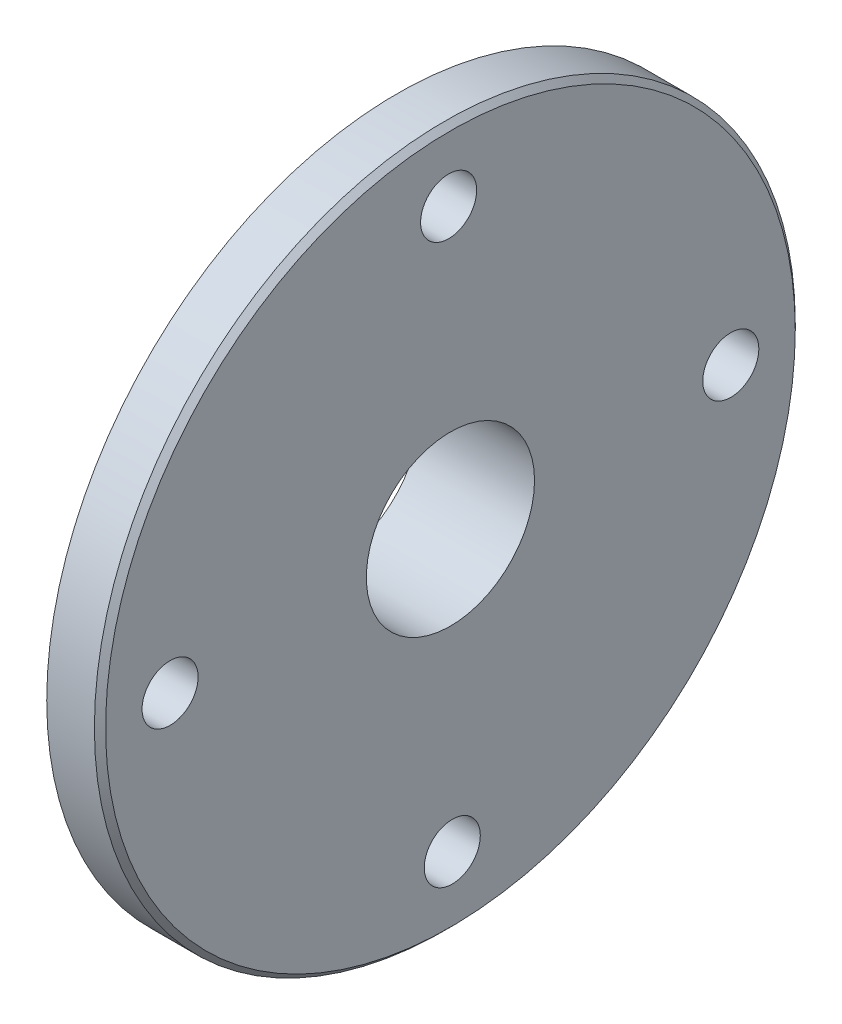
ISO-10303-21;
HEADER;
FILE_DESCRIPTION(('STEP AP214'),'2;1');
FILE_NAME('part.step','',(''),(''),'','','');
FILE_SCHEMA(('AUTOMOTIVE_DESIGN { 1 0 10303 214 1 1 1 1 }'));
ENDSEC;
DATA;
#1=APPLICATION_CONTEXT('core data for automotive mechanical design processes');
#2=APPLICATION_PROTOCOL_DEFINITION('international standard','automotive_design',2000,#1);
#3=PRODUCT_CONTEXT('',#1,'mechanical');
#4=PRODUCT('Part','Part','',(#3));
#5=PRODUCT_RELATED_PRODUCT_CATEGORY('part','',(#4));
#6=PRODUCT_DEFINITION_FORMATION('','',#4);
#7=PRODUCT_DEFINITION_CONTEXT('part definition',#1,'design');
#8=PRODUCT_DEFINITION('design','',#6,#7);
#9=PRODUCT_DEFINITION_SHAPE('','',#8);
#10=(LENGTH_UNIT() NAMED_UNIT(*) SI_UNIT(.MILLI.,.METRE.));
#11=(NAMED_UNIT(*) PLANE_ANGLE_UNIT() SI_UNIT($,.RADIAN.));
#12=(NAMED_UNIT(*) SI_UNIT($,.STERADIAN.) SOLID_ANGLE_UNIT());
#13=UNCERTAINTY_MEASURE_WITH_UNIT(LENGTH_MEASURE(1.E-05),#10,'distance_accuracy_value','');
#14=(GEOMETRIC_REPRESENTATION_CONTEXT(3) GLOBAL_UNCERTAINTY_ASSIGNED_CONTEXT((#13)) GLOBAL_UNIT_ASSIGNED_CONTEXT((#10,
#11,#12)) REPRESENTATION_CONTEXT('',''));
#15=CARTESIAN_POINT('',(0.,0.,0.));
#16=DIRECTION('',(0.,0.,1.));
#17=DIRECTION('',(1.,0.,0.));
#18=AXIS2_PLACEMENT_3D('',#15,#16,#17);
#19=CARTESIAN_POINT('',(-9.5,62.5,0.));
#20=DIRECTION('',(-1.,0.,0.));
#21=DIRECTION('',(0.,0.,1.));
#22=AXIS2_PLACEMENT_3D('',#19,#20,#21);
#23=PLANE('',#22);
#24=CARTESIAN_POINT('',(-9.50000000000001,-49.9989382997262,-0.325835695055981));
#25=DIRECTION('',(1.,0.,0.));
#26=DIRECTION('',(0.,0.,-1.));
#27=AXIS2_PLACEMENT_3D('',#24,#25,#26);
#28=CIRCLE('',#27,5.);
#29=CARTESIAN_POINT('',(-9.50000000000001,-49.9989382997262,-5.32583569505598));
#30=VERTEX_POINT('',#29);
#31=EDGE_CURVE('E71',#30,#30,#28,.T.);
#32=ORIENTED_EDGE('',*,*,#31,.T.);
#33=EDGE_LOOP('',(#32));
#34=FACE_BOUND('',#33,.T.);
#35=CARTESIAN_POINT('',(-9.50000000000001,49.9989382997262,0.325835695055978));
#36=DIRECTION('',(1.,0.,0.));
#37=DIRECTION('',(0.,0.,-1.));
#38=AXIS2_PLACEMENT_3D('',#35,#36,#37);
#39=CIRCLE('',#38,4.99999999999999);
#40=CARTESIAN_POINT('',(-9.50000000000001,49.9989382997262,-4.67416430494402));
#41=VERTEX_POINT('',#40);
#42=EDGE_CURVE('E59',#41,#41,#39,.T.);
#43=ORIENTED_EDGE('',*,*,#42,.T.);
#44=EDGE_LOOP('',(#43));
#45=FACE_BOUND('',#44,.T.);
#46=CARTESIAN_POINT('',(-9.5,0.,0.));
#47=DIRECTION('',(1.,0.,0.));
#48=DIRECTION('',(0.,0.,-1.));
#49=AXIS2_PLACEMENT_3D('',#46,#47,#48);
#50=CIRCLE('',#49,40.);
#51=CARTESIAN_POINT('',(-9.5,0.,-40.));
#52=VERTEX_POINT('',#51);
#53=EDGE_CURVE('E47',#52,#52,#50,.T.);
#54=ORIENTED_EDGE('',*,*,#53,.T.);
#55=EDGE_LOOP('',(#54));
#56=FACE_BOUND('',#55,.T.);
#57=CARTESIAN_POINT('',(-9.5,0.,0.));
#58=DIRECTION('',(1.,0.,0.));
#59=DIRECTION('',(0.,0.,-1.));
#60=AXIS2_PLACEMENT_3D('',#57,#58,#59);
#61=CIRCLE('',#60,62.5);
#62=CARTESIAN_POINT('',(-9.5,0.,-62.5));
#63=VERTEX_POINT('',#62);
#64=EDGE_CURVE('E44',#63,#63,#61,.T.);
#65=ORIENTED_EDGE('',*,*,#64,.F.);
#66=EDGE_LOOP('',(#65));
#67=FACE_BOUND('',#66,.T.);
#68=CARTESIAN_POINT('',(-9.50000000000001,0.325835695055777,-49.9989382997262));
#69=DIRECTION('',(1.,0.,0.));
#70=DIRECTION('',(0.,0.,-1.));
#71=AXIS2_PLACEMENT_3D('',#68,#69,#70);
#72=CIRCLE('',#71,5.);
#73=CARTESIAN_POINT('',(-9.50000000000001,0.325835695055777,-54.9989382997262));
#74=VERTEX_POINT('',#73);
#75=EDGE_CURVE('E65',#74,#74,#72,.T.);
#76=ORIENTED_EDGE('',*,*,#75,.T.);
#77=EDGE_LOOP('',(#76));
#78=FACE_BOUND('',#77,.T.);
#79=CARTESIAN_POINT('',(-9.50000000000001,-0.325835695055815,49.9989382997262));
#80=DIRECTION('',(1.,0.,0.));
#81=DIRECTION('',(0.,0.,-1.));
#82=AXIS2_PLACEMENT_3D('',#79,#80,#81);
#83=CIRCLE('',#82,5.);
#84=CARTESIAN_POINT('',(-9.50000000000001,-0.325835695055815,44.9989382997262));
#85=VERTEX_POINT('',#84);
#86=EDGE_CURVE('E77',#85,#85,#83,.T.);
#87=ORIENTED_EDGE('',*,*,#86,.T.);
#88=EDGE_LOOP('',(#87));
#89=FACE_BOUND('',#88,.T.);
#90=ADVANCED_FACE('F24',(#34,#45,#56,#67,#78,#89),#23,.T.);
#91=CARTESIAN_POINT('',(0.,15.,0.));
#92=DIRECTION('',(1.,0.,0.));
#93=DIRECTION('',(0.,0.,-1.));
#94=AXIS2_PLACEMENT_3D('',#91,#92,#93);
#95=PLANE('',#94);
#96=CARTESIAN_POINT('',(0.,-49.9989382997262,-0.325835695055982));
#97=DIRECTION('',(1.,0.,0.));
#98=DIRECTION('',(0.,0.,-1.));
#99=AXIS2_PLACEMENT_3D('',#96,#97,#98);
#100=CIRCLE('',#99,5.);
#101=CARTESIAN_POINT('',(0.,-49.9989382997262,-5.32583569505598));
#102=VERTEX_POINT('',#101);
#103=EDGE_CURVE('E68',#102,#102,#100,.T.);
#104=ORIENTED_EDGE('',*,*,#103,.F.);
#105=EDGE_LOOP('',(#104));
#106=FACE_BOUND('',#105,.T.);
#107=CARTESIAN_POINT('',(0.,49.9989382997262,0.325835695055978));
#108=DIRECTION('',(1.,0.,0.));
#109=DIRECTION('',(0.,0.,-1.));
#110=AXIS2_PLACEMENT_3D('',#107,#108,#109);
#111=CIRCLE('',#110,4.99999999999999);
#112=CARTESIAN_POINT('',(0.,49.9989382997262,-4.67416430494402));
#113=VERTEX_POINT('',#112);
#114=EDGE_CURVE('E56',#113,#113,#111,.T.);
#115=ORIENTED_EDGE('',*,*,#114,.F.);
#116=EDGE_LOOP('',(#115));
#117=FACE_BOUND('',#116,.T.);
#118=CARTESIAN_POINT('',(0.,0.,0.));
#119=DIRECTION('',(1.,0.,0.));
#120=DIRECTION('',(0.,0.,-1.));
#121=AXIS2_PLACEMENT_3D('',#118,#119,#120);
#122=CIRCLE('',#121,61.5);
#123=CARTESIAN_POINT('',(0.,0.,-61.5));
#124=VERTEX_POINT('',#123);
#125=EDGE_CURVE('E31',#124,#124,#122,.T.);
#126=ORIENTED_EDGE('',*,*,#125,.T.);
#127=EDGE_LOOP('',(#126));
#128=FACE_BOUND('',#127,.T.);
#129=CARTESIAN_POINT('',(0.,0.,0.));
#130=DIRECTION('',(1.,0.,0.));
#131=DIRECTION('',(0.,0.,-1.));
#132=AXIS2_PLACEMENT_3D('',#129,#130,#131);
#133=CIRCLE('',#132,15.);
#134=CARTESIAN_POINT('',(0.,0.,-15.));
#135=VERTEX_POINT('',#134);
#136=EDGE_CURVE('E53',#135,#135,#133,.T.);
#137=ORIENTED_EDGE('',*,*,#136,.F.);
#138=EDGE_LOOP('',(#137));
#139=FACE_BOUND('',#138,.T.);
#140=CARTESIAN_POINT('',(0.,0.325835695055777,-49.9989382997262));
#141=DIRECTION('',(1.,0.,0.));
#142=DIRECTION('',(0.,0.,-1.));
#143=AXIS2_PLACEMENT_3D('',#140,#141,#142);
#144=CIRCLE('',#143,5.);
#145=CARTESIAN_POINT('',(0.,0.325835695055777,-54.9989382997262));
#146=VERTEX_POINT('',#145);
#147=EDGE_CURVE('E62',#146,#146,#144,.T.);
#148=ORIENTED_EDGE('',*,*,#147,.F.);
#149=EDGE_LOOP('',(#148));
#150=FACE_BOUND('',#149,.T.);
#151=CARTESIAN_POINT('',(0.,-0.325835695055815,49.9989382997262));
#152=DIRECTION('',(1.,0.,0.));
#153=DIRECTION('',(0.,0.,-1.));
#154=AXIS2_PLACEMENT_3D('',#151,#152,#153);
#155=CIRCLE('',#154,5.);
#156=CARTESIAN_POINT('',(0.,-0.325835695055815,44.9989382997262));
#157=VERTEX_POINT('',#156);
#158=EDGE_CURVE('E74',#157,#157,#155,.T.);
#159=ORIENTED_EDGE('',*,*,#158,.F.);
#160=EDGE_LOOP('',(#159));
#161=FACE_BOUND('',#160,.T.);
#162=ADVANCED_FACE('F94',(#106,#117,#128,#139,#150,#161),#95,.T.);
#163=CARTESIAN_POINT('',(0.,0.,0.));
#164=DIRECTION('',(1.,0.,0.));
#165=DIRECTION('',(0.,0.,-1.));
#166=AXIS2_PLACEMENT_3D('',#163,#164,#165);
#167=CYLINDRICAL_SURFACE('',#166,62.5);
#168=CARTESIAN_POINT('',(-1.00000000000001,0.,0.));
#169=DIRECTION('',(1.,0.,0.));
#170=DIRECTION('',(0.,0.,-1.));
#171=AXIS2_PLACEMENT_3D('',#168,#169,#170);
#172=CIRCLE('',#171,62.5);
#173=CARTESIAN_POINT('',(-1.00000000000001,0.,-62.5));
#174=VERTEX_POINT('',#173);
#175=EDGE_CURVE('E10',#174,#174,#172,.F.);
#176=ORIENTED_EDGE('',*,*,#175,.T.);
#177=EDGE_LOOP('',(#176));
#178=FACE_BOUND('',#177,.T.);
#179=ORIENTED_EDGE('',*,*,#64,.T.);
#180=EDGE_LOOP('',(#179));
#181=FACE_BOUND('',#180,.T.);
#182=ADVANCED_FACE('F26',(#178,#181),#167,.T.);
#183=CARTESIAN_POINT('',(0.,0.,0.));
#184=DIRECTION('',(1.,0.,0.));
#185=DIRECTION('',(0.,0.,-1.));
#186=AXIS2_PLACEMENT_3D('',#183,#184,#185);
#187=CYLINDRICAL_SURFACE('',#186,40.);
#188=CARTESIAN_POINT('',(-19.5,0.,0.));
#189=DIRECTION('',(-1.,0.,0.));
#190=DIRECTION('',(0.,0.,1.));
#191=AXIS2_PLACEMENT_3D('',#188,#189,#190);
#192=CIRCLE('',#191,40.);
#193=CARTESIAN_POINT('',(-19.5,0.,40.));
#194=VERTEX_POINT('',#193);
#195=EDGE_CURVE('E39',#194,#194,#192,.F.);
#196=ORIENTED_EDGE('',*,*,#195,.T.);
#197=EDGE_LOOP('',(#196));
#198=FACE_BOUND('',#197,.T.);
#199=ORIENTED_EDGE('',*,*,#53,.F.);
#200=EDGE_LOOP('',(#199));
#201=FACE_BOUND('',#200,.T.);
#202=ADVANCED_FACE('F104',(#198,#201),#187,.T.);
#203=CARTESIAN_POINT('',(-20.5,40.,0.));
#204=DIRECTION('',(-1.,0.,0.));
#205=DIRECTION('',(0.,0.,1.));
#206=AXIS2_PLACEMENT_3D('',#203,#204,#205);
#207=PLANE('',#206);
#208=CARTESIAN_POINT('',(-20.5,0.,0.));
#209=DIRECTION('',(-1.,0.,0.));
#210=DIRECTION('',(0.,0.,1.));
#211=AXIS2_PLACEMENT_3D('',#208,#209,#210);
#212=CIRCLE('',#211,39.);
#213=CARTESIAN_POINT('',(-20.5,0.,39.));
#214=VERTEX_POINT('',#213);
#215=EDGE_CURVE('E35',#214,#214,#212,.T.);
#216=ORIENTED_EDGE('',*,*,#215,.T.);
#217=EDGE_LOOP('',(#216));
#218=FACE_BOUND('',#217,.T.);
#219=CARTESIAN_POINT('',(-20.5,0.,0.));
#220=DIRECTION('',(1.,0.,0.));
#221=DIRECTION('',(0.,0.,-1.));
#222=AXIS2_PLACEMENT_3D('',#219,#220,#221);
#223=CIRCLE('',#222,15.);
#224=CARTESIAN_POINT('',(-20.5,0.,-15.));
#225=VERTEX_POINT('',#224);
#226=EDGE_CURVE('E50',#225,#225,#223,.T.);
#227=ORIENTED_EDGE('',*,*,#226,.T.);
#228=EDGE_LOOP('',(#227));
#229=FACE_BOUND('',#228,.T.);
#230=ADVANCED_FACE('F107',(#218,#229),#207,.T.);
#231=CARTESIAN_POINT('',(0.,0.,0.));
#232=DIRECTION('',(1.,0.,0.));
#233=DIRECTION('',(0.,0.,-1.));
#234=AXIS2_PLACEMENT_3D('',#231,#232,#233);
#235=CYLINDRICAL_SURFACE('',#234,15.);
#236=ORIENTED_EDGE('',*,*,#136,.T.);
#237=EDGE_LOOP('',(#236));
#238=FACE_BOUND('',#237,.T.);
#239=ORIENTED_EDGE('',*,*,#226,.F.);
#240=EDGE_LOOP('',(#239));
#241=FACE_BOUND('',#240,.T.);
#242=ADVANCED_FACE('F111',(#238,#241),#235,.F.);
#243=CARTESIAN_POINT('',(-19.5,0.,0.));
#244=DIRECTION('',(1.,0.,0.));
#245=DIRECTION('',(0.,0.,-1.));
#246=AXIS2_PLACEMENT_3D('',#243,#244,#245);
#247=CONICAL_SURFACE('',#246,40.,0.785398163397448);
#248=ORIENTED_EDGE('',*,*,#215,.F.);
#249=EDGE_LOOP('',(#248));
#250=FACE_BOUND('',#249,.T.);
#251=ORIENTED_EDGE('',*,*,#195,.F.);
#252=EDGE_LOOP('',(#251));
#253=FACE_BOUND('',#252,.T.);
#254=ADVANCED_FACE('F114',(#250,#253),#247,.T.);
#255=CARTESIAN_POINT('',(0.,0.,0.));
#256=DIRECTION('',(-1.,0.,0.));
#257=DIRECTION('',(0.,0.,1.));
#258=AXIS2_PLACEMENT_3D('',#255,#256,#257);
#259=CONICAL_SURFACE('',#258,61.5,0.785398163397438);
#260=ORIENTED_EDGE('',*,*,#175,.F.);
#261=EDGE_LOOP('',(#260));
#262=FACE_BOUND('',#261,.T.);
#263=ORIENTED_EDGE('',*,*,#125,.F.);
#264=EDGE_LOOP('',(#263));
#265=FACE_BOUND('',#264,.T.);
#266=ADVANCED_FACE('F119',(#262,#265),#259,.T.);
#267=CARTESIAN_POINT('',(0.,49.9989382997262,0.325835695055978));
#268=DIRECTION('',(-1.,0.,0.));
#269=DIRECTION('',(0.,0.,1.));
#270=AXIS2_PLACEMENT_3D('',#267,#268,#269);
#271=CYLINDRICAL_SURFACE('',#270,4.99999999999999);
#272=ORIENTED_EDGE('',*,*,#114,.T.);
#273=EDGE_LOOP('',(#272));
#274=FACE_BOUND('',#273,.T.);
#275=ORIENTED_EDGE('',*,*,#42,.F.);
#276=EDGE_LOOP('',(#275));
#277=FACE_BOUND('',#276,.T.);
#278=ADVANCED_FACE('F122',(#274,#277),#271,.F.);
#279=CARTESIAN_POINT('',(0.,0.325835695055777,-49.9989382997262));
#280=DIRECTION('',(-1.,0.,0.));
#281=DIRECTION('',(0.,0.,1.));
#282=AXIS2_PLACEMENT_3D('',#279,#280,#281);
#283=CYLINDRICAL_SURFACE('',#282,5.);
#284=ORIENTED_EDGE('',*,*,#147,.T.);
#285=EDGE_LOOP('',(#284));
#286=FACE_BOUND('',#285,.T.);
#287=ORIENTED_EDGE('',*,*,#75,.F.);
#288=EDGE_LOOP('',(#287));
#289=FACE_BOUND('',#288,.T.);
#290=ADVANCED_FACE('F90',(#286,#289),#283,.F.);
#291=CARTESIAN_POINT('',(0.,-49.9989382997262,-0.325835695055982));
#292=DIRECTION('',(-1.,0.,0.));
#293=DIRECTION('',(0.,0.,1.));
#294=AXIS2_PLACEMENT_3D('',#291,#292,#293);
#295=CYLINDRICAL_SURFACE('',#294,5.);
#296=ORIENTED_EDGE('',*,*,#103,.T.);
#297=EDGE_LOOP('',(#296));
#298=FACE_BOUND('',#297,.T.);
#299=ORIENTED_EDGE('',*,*,#31,.F.);
#300=EDGE_LOOP('',(#299));
#301=FACE_BOUND('',#300,.T.);
#302=ADVANCED_FACE('F84',(#298,#301),#295,.F.);
#303=CARTESIAN_POINT('',(0.,-0.325835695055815,49.9989382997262));
#304=DIRECTION('',(-1.,0.,0.));
#305=DIRECTION('',(0.,0.,1.));
#306=AXIS2_PLACEMENT_3D('',#303,#304,#305);
#307=CYLINDRICAL_SURFACE('',#306,5.);
#308=ORIENTED_EDGE('',*,*,#158,.T.);
#309=EDGE_LOOP('',(#308));
#310=FACE_BOUND('',#309,.T.);
#311=ORIENTED_EDGE('',*,*,#86,.F.);
#312=EDGE_LOOP('',(#311));
#313=FACE_BOUND('',#312,.T.);
#314=ADVANCED_FACE('F82',(#310,#313),#307,.F.);
#315=CLOSED_SHELL('',(#90,#162,#182,#202,#230,#242,#254,#266,#278,#290,#302,#314));
#316=MANIFOLD_SOLID_BREP('B2',#315);
#317=ADVANCED_BREP_SHAPE_REPRESENTATION('',(#18,#316),#14);
#318=SHAPE_DEFINITION_REPRESENTATION(#9,#317);
ENDSEC;
END-ISO-10303-21;
